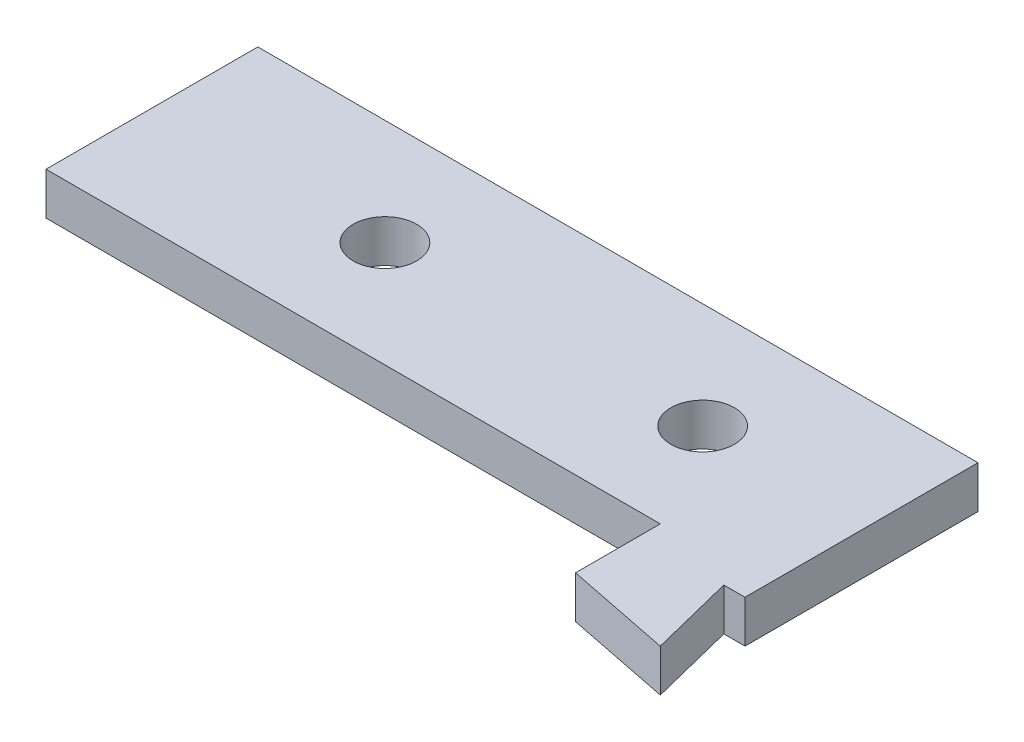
ISO-10303-21;
HEADER;
FILE_DESCRIPTION(('STEP AP214'),'2;1');
FILE_NAME('part.step','',(''),(''),'','','');
FILE_SCHEMA(('AUTOMOTIVE_DESIGN { 1 0 10303 214 1 1 1 1 }'));
ENDSEC;
DATA;
#1=APPLICATION_CONTEXT('core data for automotive mechanical design processes');
#2=APPLICATION_PROTOCOL_DEFINITION('international standard','automotive_design',2000,#1);
#3=PRODUCT_CONTEXT('',#1,'mechanical');
#4=PRODUCT('Part','Part','',(#3));
#5=PRODUCT_RELATED_PRODUCT_CATEGORY('part','',(#4));
#6=PRODUCT_DEFINITION_FORMATION('','',#4);
#7=PRODUCT_DEFINITION_CONTEXT('part definition',#1,'design');
#8=PRODUCT_DEFINITION('design','',#6,#7);
#9=PRODUCT_DEFINITION_SHAPE('','',#8);
#10=(LENGTH_UNIT() NAMED_UNIT(*) SI_UNIT(.MILLI.,.METRE.));
#11=(NAMED_UNIT(*) PLANE_ANGLE_UNIT() SI_UNIT($,.RADIAN.));
#12=(NAMED_UNIT(*) SI_UNIT($,.STERADIAN.) SOLID_ANGLE_UNIT());
#13=UNCERTAINTY_MEASURE_WITH_UNIT(LENGTH_MEASURE(1.E-05),#10,'distance_accuracy_value','');
#14=(GEOMETRIC_REPRESENTATION_CONTEXT(3) GLOBAL_UNCERTAINTY_ASSIGNED_CONTEXT((#13)) GLOBAL_UNIT_ASSIGNED_CONTEXT((#10,
#11,#12)) REPRESENTATION_CONTEXT('',''));
#15=CARTESIAN_POINT('',(0.,0.,0.));
#16=DIRECTION('',(0.,0.,1.));
#17=DIRECTION('',(1.,0.,0.));
#18=AXIS2_PLACEMENT_3D('',#15,#16,#17);
#19=CARTESIAN_POINT('',(0.,4.,0.));
#20=DIRECTION('',(1.,0.,0.));
#21=DIRECTION('',(0.,0.,-1.));
#22=AXIS2_PLACEMENT_3D('',#19,#20,#21);
#23=PLANE('',#22);
#24=DIRECTION('',(0.,0.,1.));
#25=VECTOR('',#24,1.);
#26=CARTESIAN_POINT('',(0.,0.,0.));
#27=LINE('',#26,#25);
#28=CARTESIAN_POINT('',(0.,0.,-30.));
#29=VERTEX_POINT('',#28);
#30=CARTESIAN_POINT('',(0.,0.,-9.99999999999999));
#31=VERTEX_POINT('',#30);
#32=EDGE_CURVE('E83',#29,#31,#27,.T.);
#33=ORIENTED_EDGE('',*,*,#32,.T.);
#34=DIRECTION('',(0.,1.,0.));
#35=VECTOR('',#34,1.);
#36=CARTESIAN_POINT('',(0.,0.,-9.99999999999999));
#37=LINE('',#36,#35);
#38=CARTESIAN_POINT('',(0.,4.,-9.99999999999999));
#39=VERTEX_POINT('',#38);
#40=EDGE_CURVE('E122',#31,#39,#37,.T.);
#41=ORIENTED_EDGE('',*,*,#40,.T.);
#42=DIRECTION('',(0.,0.,1.));
#43=VECTOR('',#42,1.);
#44=CARTESIAN_POINT('',(0.,4.,0.));
#45=LINE('',#44,#43);
#46=CARTESIAN_POINT('',(0.,4.,-30.));
#47=VERTEX_POINT('',#46);
#48=EDGE_CURVE('E76',#47,#39,#45,.T.);
#49=ORIENTED_EDGE('',*,*,#48,.F.);
#50=DIRECTION('',(0.,-1.,0.));
#51=VECTOR('',#50,1.);
#52=CARTESIAN_POINT('',(0.,4.,-30.));
#53=LINE('',#52,#51);
#54=EDGE_CURVE('E70',#47,#29,#53,.T.);
#55=ORIENTED_EDGE('',*,*,#54,.T.);
#56=EDGE_LOOP('',(#33,#41,#49,#55));
#57=FACE_BOUND('',#56,.T.);
#58=ADVANCED_FACE('F32',(#57),#23,.F.);
#59=CARTESIAN_POINT('',(68.,4.,0.));
#60=DIRECTION('',(-1.,0.,0.));
#61=DIRECTION('',(0.,0.,1.));
#62=AXIS2_PLACEMENT_3D('',#59,#60,#61);
#63=PLANE('',#62);
#64=DIRECTION('',(0.,0.,-1.));
#65=VECTOR('',#64,1.);
#66=CARTESIAN_POINT('',(68.,4.,0.));
#67=LINE('',#66,#65);
#68=CARTESIAN_POINT('',(68.,4.,-8.));
#69=VERTEX_POINT('',#68);
#70=CARTESIAN_POINT('',(68.,4.,-30.));
#71=VERTEX_POINT('',#70);
#72=EDGE_CURVE('E99',#69,#71,#67,.T.);
#73=ORIENTED_EDGE('',*,*,#72,.F.);
#74=DIRECTION('',(0.,1.,0.));
#75=VECTOR('',#74,1.);
#76=CARTESIAN_POINT('',(68.,0.,-8.));
#77=LINE('',#76,#75);
#78=CARTESIAN_POINT('',(68.,0.,-8.));
#79=VERTEX_POINT('',#78);
#80=EDGE_CURVE('E111',#79,#69,#77,.T.);
#81=ORIENTED_EDGE('',*,*,#80,.F.);
#82=DIRECTION('',(0.,0.,-1.));
#83=VECTOR('',#82,1.);
#84=CARTESIAN_POINT('',(68.,0.,0.));
#85=LINE('',#84,#83);
#86=CARTESIAN_POINT('',(68.,0.,-30.));
#87=VERTEX_POINT('',#86);
#88=EDGE_CURVE('E77',#79,#87,#85,.T.);
#89=ORIENTED_EDGE('',*,*,#88,.T.);
#90=DIRECTION('',(0.,-1.,0.));
#91=VECTOR('',#90,1.);
#92=CARTESIAN_POINT('',(68.,4.,-30.));
#93=LINE('',#92,#91);
#94=EDGE_CURVE('E39',#71,#87,#93,.T.);
#95=ORIENTED_EDGE('',*,*,#94,.F.);
#96=EDGE_LOOP('',(#73,#81,#89,#95));
#97=FACE_BOUND('',#96,.T.);
#98=ADVANCED_FACE('F198',(#97),#63,.F.);
#99=CARTESIAN_POINT('',(0.,4.,-30.));
#100=DIRECTION('',(0.,0.,1.));
#101=DIRECTION('',(1.,0.,0.));
#102=AXIS2_PLACEMENT_3D('',#99,#100,#101);
#103=PLANE('',#102);
#104=DIRECTION('',(-1.,0.,0.));
#105=VECTOR('',#104,1.);
#106=CARTESIAN_POINT('',(0.,0.,-30.));
#107=LINE('',#106,#105);
#108=EDGE_CURVE('E67',#87,#29,#107,.T.);
#109=ORIENTED_EDGE('',*,*,#108,.T.);
#110=ORIENTED_EDGE('',*,*,#54,.F.);
#111=DIRECTION('',(-1.,0.,0.));
#112=VECTOR('',#111,1.);
#113=CARTESIAN_POINT('',(0.,4.,-30.));
#114=LINE('',#113,#112);
#115=EDGE_CURVE('E54',#71,#47,#114,.T.);
#116=ORIENTED_EDGE('',*,*,#115,.F.);
#117=ORIENTED_EDGE('',*,*,#94,.T.);
#118=EDGE_LOOP('',(#109,#110,#116,#117));
#119=FACE_BOUND('',#118,.T.);
#120=ADVANCED_FACE('F69',(#119),#103,.F.);
#121=CARTESIAN_POINT('',(0.,4.,-30.));
#122=DIRECTION('',(0.,-1.,0.));
#123=DIRECTION('',(0.,0.,-1.));
#124=AXIS2_PLACEMENT_3D('',#121,#122,#123);
#125=PLANE('',#124);
#126=CARTESIAN_POINT('',(52.,4.,-20.));
#127=DIRECTION('',(0.,1.,0.));
#128=DIRECTION('',(0.,0.,1.));
#129=AXIS2_PLACEMENT_3D('',#126,#127,#128);
#130=CIRCLE('',#129,3.);
#131=CARTESIAN_POINT('',(52.,4.,-17.));
#132=VERTEX_POINT('',#131);
#133=EDGE_CURVE('E105',#132,#132,#130,.T.);
#134=ORIENTED_EDGE('',*,*,#133,.F.);
#135=EDGE_LOOP('',(#134));
#136=FACE_BOUND('',#135,.T.);
#137=CARTESIAN_POINT('',(22.,4.,-20.));
#138=DIRECTION('',(0.,1.,0.));
#139=DIRECTION('',(0.,0.,1.));
#140=AXIS2_PLACEMENT_3D('',#137,#138,#139);
#141=CIRCLE('',#140,3.);
#142=CARTESIAN_POINT('',(22.,4.,-17.));
#143=VERTEX_POINT('',#142);
#144=EDGE_CURVE('E95',#143,#143,#141,.T.);
#145=ORIENTED_EDGE('',*,*,#144,.F.);
#146=EDGE_LOOP('',(#145));
#147=FACE_BOUND('',#146,.T.);
#148=ORIENTED_EDGE('',*,*,#48,.T.);
#149=DIRECTION('',(-1.,0.,0.));
#150=VECTOR('',#149,1.);
#151=CARTESIAN_POINT('',(58.,4.,-10.));
#152=LINE('',#151,#150);
#153=CARTESIAN_POINT('',(58.,4.,-10.));
#154=VERTEX_POINT('',#153);
#155=EDGE_CURVE('E133',#154,#39,#152,.T.);
#156=ORIENTED_EDGE('',*,*,#155,.F.);
#157=DIRECTION('',(0.,0.,-1.));
#158=VECTOR('',#157,1.);
#159=CARTESIAN_POINT('',(58.,4.,-2.));
#160=LINE('',#159,#158);
#161=CARTESIAN_POINT('',(58.,4.,-2.));
#162=VERTEX_POINT('',#161);
#163=EDGE_CURVE('E137',#162,#154,#160,.T.);
#164=ORIENTED_EDGE('',*,*,#163,.F.);
#165=DIRECTION('',(-0.98058067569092,0.,-0.196116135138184));
#166=VECTOR('',#165,1.);
#167=CARTESIAN_POINT('',(68.,4.,0.));
#168=LINE('',#167,#166);
#169=CARTESIAN_POINT('',(68.,4.,0.));
#170=VERTEX_POINT('',#169);
#171=EDGE_CURVE('E140',#170,#162,#168,.T.);
#172=ORIENTED_EDGE('',*,*,#171,.F.);
#173=DIRECTION('',(0.242535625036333,0.,0.970142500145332));
#174=VECTOR('',#173,1.);
#175=CARTESIAN_POINT('',(68.,4.,0.));
#176=LINE('',#175,#174);
#177=CARTESIAN_POINT('',(66.,4.,-8.));
#178=VERTEX_POINT('',#177);
#179=EDGE_CURVE('E115',#178,#170,#176,.T.);
#180=ORIENTED_EDGE('',*,*,#179,.F.);
#181=DIRECTION('',(-1.,0.,0.));
#182=VECTOR('',#181,1.);
#183=CARTESIAN_POINT('',(66.,4.,-8.));
#184=LINE('',#183,#182);
#185=EDGE_CURVE('E119',#69,#178,#184,.T.);
#186=ORIENTED_EDGE('',*,*,#185,.F.);
#187=ORIENTED_EDGE('',*,*,#72,.T.);
#188=ORIENTED_EDGE('',*,*,#115,.T.);
#189=EDGE_LOOP('',(#148,#156,#164,#172,#180,#186,#187,#188));
#190=FACE_BOUND('',#189,.T.);
#191=ADVANCED_FACE('F167',(#136,#147,#190),#125,.F.);
#192=CARTESIAN_POINT('',(0.,0.,-30.));
#193=DIRECTION('',(0.,-1.,0.));
#194=DIRECTION('',(0.,0.,-1.));
#195=AXIS2_PLACEMENT_3D('',#192,#193,#194);
#196=PLANE('',#195);
#197=DIRECTION('',(-1.,0.,0.));
#198=VECTOR('',#197,1.);
#199=CARTESIAN_POINT('',(58.,0.,-10.));
#200=LINE('',#199,#198);
#201=CARTESIAN_POINT('',(58.,0.,-10.));
#202=VERTEX_POINT('',#201);
#203=EDGE_CURVE('E90',#202,#31,#200,.T.);
#204=ORIENTED_EDGE('',*,*,#203,.T.);
#205=ORIENTED_EDGE('',*,*,#32,.F.);
#206=ORIENTED_EDGE('',*,*,#108,.F.);
#207=ORIENTED_EDGE('',*,*,#88,.F.);
#208=DIRECTION('',(-1.,0.,0.));
#209=VECTOR('',#208,1.);
#210=CARTESIAN_POINT('',(66.,0.,-8.));
#211=LINE('',#210,#209);
#212=CARTESIAN_POINT('',(66.,0.,-8.));
#213=VERTEX_POINT('',#212);
#214=EDGE_CURVE('E118',#79,#213,#211,.T.);
#215=ORIENTED_EDGE('',*,*,#214,.T.);
#216=DIRECTION('',(0.242535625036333,0.,0.970142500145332));
#217=VECTOR('',#216,1.);
#218=CARTESIAN_POINT('',(68.,0.,0.));
#219=LINE('',#218,#217);
#220=CARTESIAN_POINT('',(68.,0.,0.));
#221=VERTEX_POINT('',#220);
#222=EDGE_CURVE('E45',#213,#221,#219,.T.);
#223=ORIENTED_EDGE('',*,*,#222,.T.);
#224=DIRECTION('',(-0.98058067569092,0.,-0.196116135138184));
#225=VECTOR('',#224,1.);
#226=CARTESIAN_POINT('',(68.,0.,0.));
#227=LINE('',#226,#225);
#228=CARTESIAN_POINT('',(58.,0.,-2.));
#229=VERTEX_POINT('',#228);
#230=EDGE_CURVE('E136',#221,#229,#227,.T.);
#231=ORIENTED_EDGE('',*,*,#230,.T.);
#232=DIRECTION('',(0.,0.,-1.));
#233=VECTOR('',#232,1.);
#234=CARTESIAN_POINT('',(58.,0.,-2.));
#235=LINE('',#234,#233);
#236=EDGE_CURVE('E144',#229,#202,#235,.T.);
#237=ORIENTED_EDGE('',*,*,#236,.T.);
#238=EDGE_LOOP('',(#204,#205,#206,#207,#215,#223,#231,#237));
#239=FACE_BOUND('',#238,.T.);
#240=CARTESIAN_POINT('',(52.,0.,-20.));
#241=DIRECTION('',(0.,1.,0.));
#242=DIRECTION('',(0.,0.,1.));
#243=AXIS2_PLACEMENT_3D('',#240,#241,#242);
#244=CIRCLE('',#243,3.);
#245=CARTESIAN_POINT('',(52.,0.,-17.));
#246=VERTEX_POINT('',#245);
#247=EDGE_CURVE('E103',#246,#246,#244,.T.);
#248=ORIENTED_EDGE('',*,*,#247,.T.);
#249=EDGE_LOOP('',(#248));
#250=FACE_BOUND('',#249,.T.);
#251=CARTESIAN_POINT('',(22.,0.,-20.));
#252=DIRECTION('',(0.,1.,0.));
#253=DIRECTION('',(0.,0.,1.));
#254=AXIS2_PLACEMENT_3D('',#251,#252,#253);
#255=CIRCLE('',#254,3.);
#256=CARTESIAN_POINT('',(22.,0.,-17.));
#257=VERTEX_POINT('',#256);
#258=EDGE_CURVE('E91',#257,#257,#255,.T.);
#259=ORIENTED_EDGE('',*,*,#258,.T.);
#260=EDGE_LOOP('',(#259));
#261=FACE_BOUND('',#260,.T.);
#262=ADVANCED_FACE('F86',(#239,#250,#261),#196,.T.);
#263=CARTESIAN_POINT('',(22.,0.,-20.));
#264=DIRECTION('',(0.,1.,0.));
#265=DIRECTION('',(0.,0.,1.));
#266=AXIS2_PLACEMENT_3D('',#263,#264,#265);
#267=CYLINDRICAL_SURFACE('',#266,3.);
#268=ORIENTED_EDGE('',*,*,#258,.F.);
#269=EDGE_LOOP('',(#268));
#270=FACE_BOUND('',#269,.T.);
#271=ORIENTED_EDGE('',*,*,#144,.T.);
#272=EDGE_LOOP('',(#271));
#273=FACE_BOUND('',#272,.T.);
#274=ADVANCED_FACE('F210',(#270,#273),#267,.F.);
#275=CARTESIAN_POINT('',(52.,0.,-20.));
#276=DIRECTION('',(0.,1.,0.));
#277=DIRECTION('',(0.,0.,1.));
#278=AXIS2_PLACEMENT_3D('',#275,#276,#277);
#279=CYLINDRICAL_SURFACE('',#278,3.);
#280=ORIENTED_EDGE('',*,*,#247,.F.);
#281=EDGE_LOOP('',(#280));
#282=FACE_BOUND('',#281,.T.);
#283=ORIENTED_EDGE('',*,*,#133,.T.);
#284=EDGE_LOOP('',(#283));
#285=FACE_BOUND('',#284,.T.);
#286=ADVANCED_FACE('F216',(#282,#285),#279,.F.);
#287=CARTESIAN_POINT('',(68.,0.,0.));
#288=DIRECTION('',(-0.970142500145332,0.,0.242535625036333));
#289=DIRECTION('',(0.242535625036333,0.,0.970142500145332));
#290=AXIS2_PLACEMENT_3D('',#287,#288,#289);
#291=PLANE('',#290);
#292=ORIENTED_EDGE('',*,*,#179,.T.);
#293=DIRECTION('',(0.,-1.,0.));
#294=VECTOR('',#293,1.);
#295=CARTESIAN_POINT('',(68.,4.,0.));
#296=LINE('',#295,#294);
#297=EDGE_CURVE('E11',#170,#221,#296,.T.);
#298=ORIENTED_EDGE('',*,*,#297,.T.);
#299=ORIENTED_EDGE('',*,*,#222,.F.);
#300=DIRECTION('',(0.,1.,0.));
#301=VECTOR('',#300,1.);
#302=CARTESIAN_POINT('',(66.,0.,-8.));
#303=LINE('',#302,#301);
#304=EDGE_CURVE('E108',#213,#178,#303,.T.);
#305=ORIENTED_EDGE('',*,*,#304,.T.);
#306=EDGE_LOOP('',(#292,#298,#299,#305));
#307=FACE_BOUND('',#306,.T.);
#308=ADVANCED_FACE('F161',(#307),#291,.F.);
#309=CARTESIAN_POINT('',(66.,0.,-8.));
#310=DIRECTION('',(0.,0.,-1.));
#311=DIRECTION('',(-1.,0.,0.));
#312=AXIS2_PLACEMENT_3D('',#309,#310,#311);
#313=PLANE('',#312);
#314=ORIENTED_EDGE('',*,*,#185,.T.);
#315=ORIENTED_EDGE('',*,*,#304,.F.);
#316=ORIENTED_EDGE('',*,*,#214,.F.);
#317=ORIENTED_EDGE('',*,*,#80,.T.);
#318=EDGE_LOOP('',(#314,#315,#316,#317));
#319=FACE_BOUND('',#318,.T.);
#320=ADVANCED_FACE('F188',(#319),#313,.F.);
#321=CARTESIAN_POINT('',(58.,0.,-10.));
#322=DIRECTION('',(0.,0.,-1.));
#323=DIRECTION('',(-1.,0.,0.));
#324=AXIS2_PLACEMENT_3D('',#321,#322,#323);
#325=PLANE('',#324);
#326=ORIENTED_EDGE('',*,*,#155,.T.);
#327=ORIENTED_EDGE('',*,*,#40,.F.);
#328=ORIENTED_EDGE('',*,*,#203,.F.);
#329=DIRECTION('',(0.,1.,0.));
#330=VECTOR('',#329,1.);
#331=CARTESIAN_POINT('',(58.,0.,-10.));
#332=LINE('',#331,#330);
#333=EDGE_CURVE('E129',#202,#154,#332,.T.);
#334=ORIENTED_EDGE('',*,*,#333,.T.);
#335=EDGE_LOOP('',(#326,#327,#328,#334));
#336=FACE_BOUND('',#335,.T.);
#337=ADVANCED_FACE('F186',(#336),#325,.F.);
#338=CARTESIAN_POINT('',(58.,0.,-2.));
#339=DIRECTION('',(1.,0.,0.));
#340=DIRECTION('',(0.,0.,-1.));
#341=AXIS2_PLACEMENT_3D('',#338,#339,#340);
#342=PLANE('',#341);
#343=ORIENTED_EDGE('',*,*,#163,.T.);
#344=ORIENTED_EDGE('',*,*,#333,.F.);
#345=ORIENTED_EDGE('',*,*,#236,.F.);
#346=DIRECTION('',(0.,1.,0.));
#347=VECTOR('',#346,1.);
#348=CARTESIAN_POINT('',(58.,0.,-2.));
#349=LINE('',#348,#347);
#350=EDGE_CURVE('E126',#229,#162,#349,.T.);
#351=ORIENTED_EDGE('',*,*,#350,.T.);
#352=EDGE_LOOP('',(#343,#344,#345,#351));
#353=FACE_BOUND('',#352,.T.);
#354=ADVANCED_FACE('F183',(#353),#342,.F.);
#355=CARTESIAN_POINT('',(68.,0.,0.));
#356=DIRECTION('',(0.196116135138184,0.,-0.98058067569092));
#357=DIRECTION('',(-0.98058067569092,0.,-0.196116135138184));
#358=AXIS2_PLACEMENT_3D('',#355,#356,#357);
#359=PLANE('',#358);
#360=ORIENTED_EDGE('',*,*,#171,.T.);
#361=ORIENTED_EDGE('',*,*,#350,.F.);
#362=ORIENTED_EDGE('',*,*,#230,.F.);
#363=ORIENTED_EDGE('',*,*,#297,.F.);
#364=EDGE_LOOP('',(#360,#361,#362,#363));
#365=FACE_BOUND('',#364,.T.);
#366=ADVANCED_FACE('F156',(#365),#359,.F.);
#367=CLOSED_SHELL('',(#58,#98,#120,#191,#262,#274,#286,#308,#320,#337,#354,#366));
#368=MANIFOLD_SOLID_BREP('B2',#367);
#369=ADVANCED_BREP_SHAPE_REPRESENTATION('',(#18,#368),#14);
#370=SHAPE_DEFINITION_REPRESENTATION(#9,#369);
ENDSEC;
END-ISO-10303-21;
